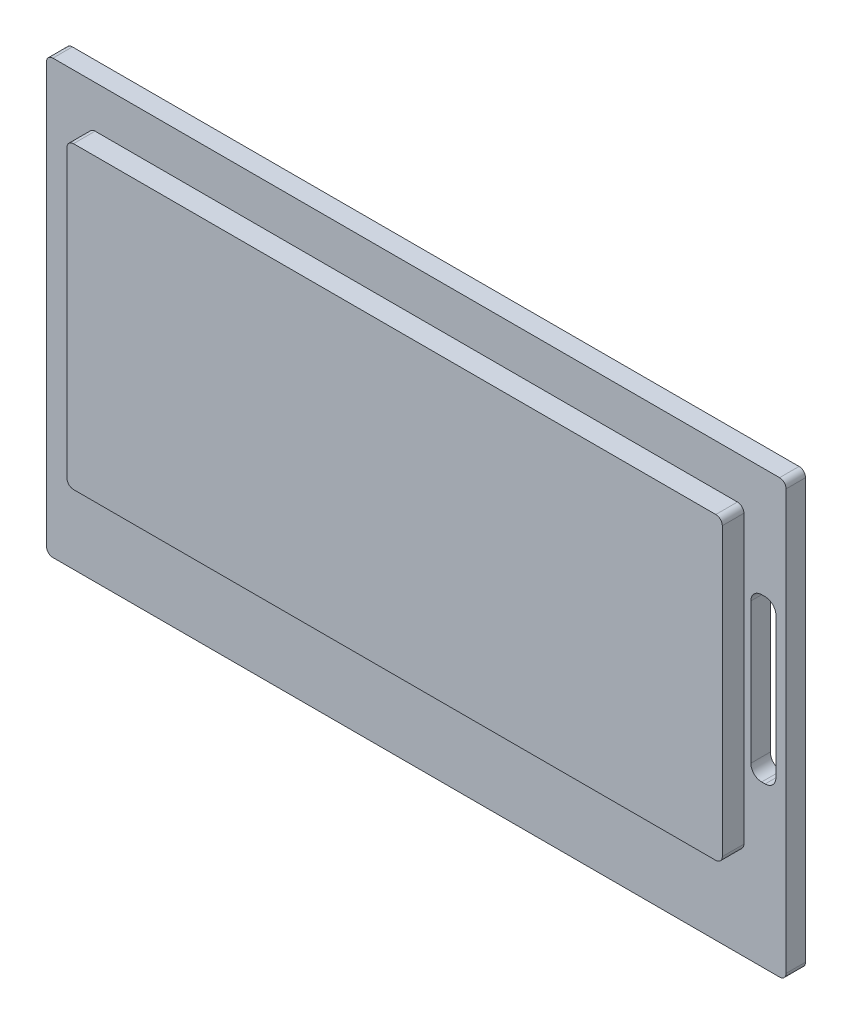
from build123d import *

# Parameters (mm, degrees)
BOSS_EXTRU_1_DEPTH      = 19
ESQUISSE3_OUTSIDE_W     = 423.328
ESQUISSE3_OUTSIDE_H     = 281.328
ENL_V_MAT_EXTRU_1_DEPTH = 10
ENL_V_MAT_EXTRU_2_DEPTH = 330.809824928


with BuildPart() as part:
    # Esquisse2 → Boss.-Extru.1 (new body)
    with BuildSketch(Plane.XY):
        with BuildLine():
            Line((-51.078982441, 159.734180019), (284.921017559, 159.734180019))
            ThreePointArc((284.921017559, 159.734180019), (287.042337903, 158.855500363), (287.921017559, 156.734180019))
            Line((287.921017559, 156.734180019), (287.921017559, -37.265819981))
            ThreePointArc((287.921017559, -37.265819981), (287.042337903, -39.387140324), (284.921017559, -40.265819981))
            Line((284.921017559, -40.265819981), (-51.078982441, -40.265819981))
            ThreePointArc((-51.078982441, -40.265819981), (-53.200302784, -39.387140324), (-54.078982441, -37.265819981))
            Line((-54.078982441, -37.265819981), (-54.078982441, 156.734180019))
            ThreePointArc((-54.078982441, 156.734180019), (-53.200302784, 158.855500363), (-51.078982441, 159.734180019))
        make_face()
    extrude(amount=BOSS_EXTRU_1_DEPTH)

    # Esquisse3 outside → Enl_v. mat.-Extru.1 (cut)
    with BuildSketch(Plane.XY.offset(19)):
        with Locations((116.921, 59.734)):
            Rectangle(ESQUISSE3_OUTSIDE_W, ESQUISSE3_OUTSIDE_H)
        with BuildLine():
            Line((-31.578982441, 140.234180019), (265.421017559, 140.234180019))
            ThreePointArc((265.421017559, 140.234180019), (267.542337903, 139.355500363), (268.421017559, 137.234180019))
            Line((268.421017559, 137.234180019), (268.421017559, 4.734180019))
            ThreePointArc((268.421017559, 4.734180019), (267.542337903, 2.612859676), (265.421017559, 1.734180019))
            Line((265.421017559, 1.734180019), (-31.578982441, 1.734180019))
            ThreePointArc((-31.578982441, 1.734180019), (-33.700302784, 2.612859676), (-34.578982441, 4.734180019))
            Line((-34.578982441, 4.734180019), (-34.578982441, 137.234180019))
            ThreePointArc((-34.578982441, 137.234180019), (-33.700302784, 139.355500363), (-31.578982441, 140.234180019))
        make_face(mode=Mode.SUBTRACT)
    extrude(amount=-ENL_V_MAT_EXTRU_1_DEPTH, mode=Mode.SUBTRACT)

    # Esquisse5 → Enl_v. mat.-Extru.2 (cut, through all)
    with BuildSketch(Plane(origin=(0, 0, 0), x_dir=(-1, 0, 0), z_dir=(0, 0, -1))):
        with BuildLine():
            Line((-278.221017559, 108.734180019), (-276.621017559, 108.734180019))
            ThreePointArc((-276.621017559, 108.734180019), (-273.085483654, 107.269713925), (-271.621017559, 103.734180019))
            Line((-271.621017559, 103.734180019), (-271.621017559, 38.734180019))
            ThreePointArc((-271.621017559, 38.734180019), (-273.085483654, 35.198646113), (-276.621017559, 33.734180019))
            Line((-276.621017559, 33.734180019), (-278.221017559, 33.734180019))
            ThreePointArc((-278.221017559, 33.734180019), (-281.756551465, 35.198646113), (-283.221017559, 38.734180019))
            Line((-283.221017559, 38.734180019), (-283.221017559, 103.734180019))
            ThreePointArc((-283.221017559, 103.734180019), (-281.756551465, 107.269713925), (-278.221017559, 108.734180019))
        make_face()
    extrude(amount=-ENL_V_MAT_EXTRU_2_DEPTH, mode=Mode.SUBTRACT)


solid = part.part
